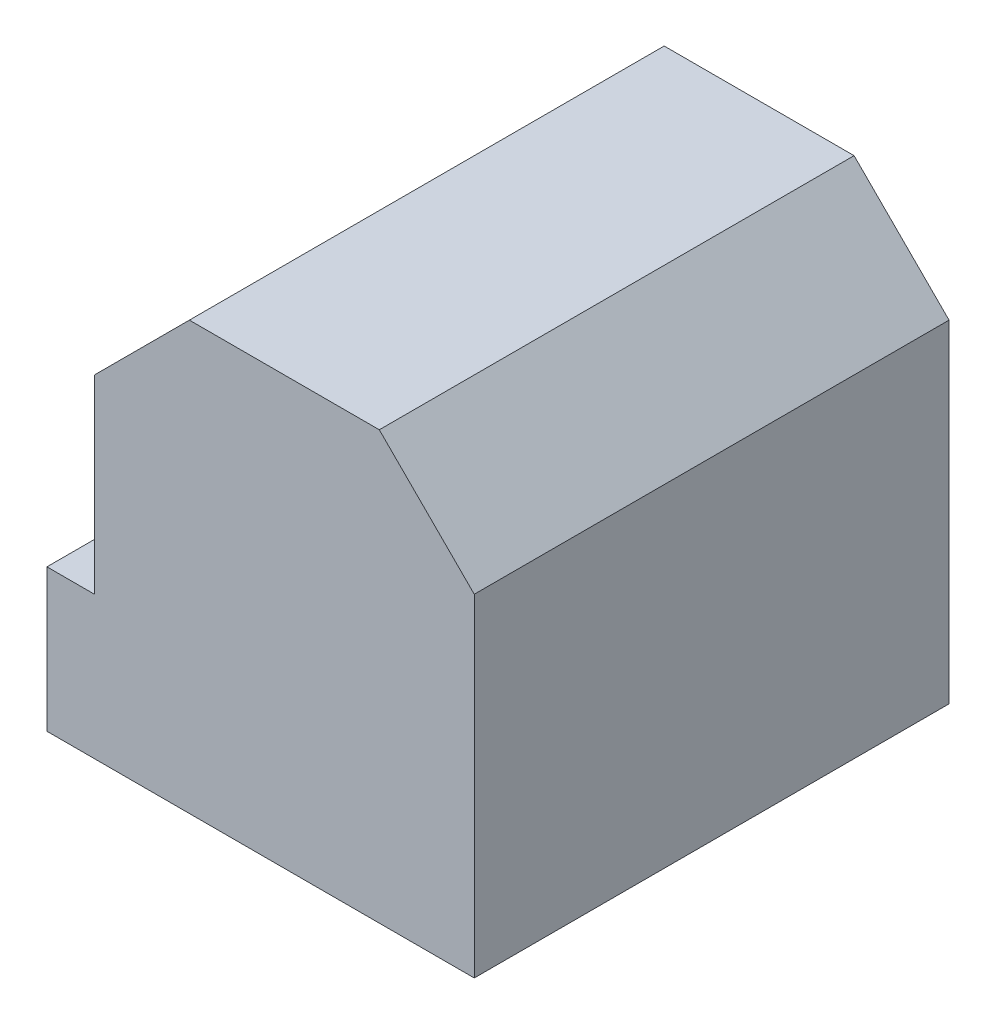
ISO-10303-21;
HEADER;
FILE_DESCRIPTION(('STEP AP214'),'2;1');
FILE_NAME('part.step','',(''),(''),'','','');
FILE_SCHEMA(('AUTOMOTIVE_DESIGN { 1 0 10303 214 1 1 1 1 }'));
ENDSEC;
DATA;
#1=APPLICATION_CONTEXT('core data for automotive mechanical design processes');
#2=APPLICATION_PROTOCOL_DEFINITION('international standard','automotive_design',2000,#1);
#3=PRODUCT_CONTEXT('',#1,'mechanical');
#4=PRODUCT('Part','Part','',(#3));
#5=PRODUCT_RELATED_PRODUCT_CATEGORY('part','',(#4));
#6=PRODUCT_DEFINITION_FORMATION('','',#4);
#7=PRODUCT_DEFINITION_CONTEXT('part definition',#1,'design');
#8=PRODUCT_DEFINITION('design','',#6,#7);
#9=PRODUCT_DEFINITION_SHAPE('','',#8);
#10=(LENGTH_UNIT() NAMED_UNIT(*) SI_UNIT(.MILLI.,.METRE.));
#11=(NAMED_UNIT(*) PLANE_ANGLE_UNIT() SI_UNIT($,.RADIAN.));
#12=(NAMED_UNIT(*) SI_UNIT($,.STERADIAN.) SOLID_ANGLE_UNIT());
#13=UNCERTAINTY_MEASURE_WITH_UNIT(LENGTH_MEASURE(1.E-05),#10,'distance_accuracy_value','');
#14=(GEOMETRIC_REPRESENTATION_CONTEXT(3) GLOBAL_UNCERTAINTY_ASSIGNED_CONTEXT((#13)) GLOBAL_UNIT_ASSIGNED_CONTEXT((#10,
#11,#12)) REPRESENTATION_CONTEXT('',''));
#15=CARTESIAN_POINT('',(0.,0.,0.));
#16=DIRECTION('',(0.,0.,1.));
#17=DIRECTION('',(1.,0.,0.));
#18=AXIS2_PLACEMENT_3D('',#15,#16,#17);
#19=CARTESIAN_POINT('',(0.,0.,25.));
#20=DIRECTION('',(1.,0.,0.));
#21=DIRECTION('',(0.,0.,-1.));
#22=AXIS2_PLACEMENT_3D('',#19,#20,#21);
#23=PLANE('',#22);
#24=DIRECTION('',(0.,0.,-1.));
#25=VECTOR('',#24,1.);
#26=CARTESIAN_POINT('',(0.,15.,25.));
#27=LINE('',#26,#25);
#28=CARTESIAN_POINT('',(0.,15.,25.));
#29=VERTEX_POINT('',#28);
#30=CARTESIAN_POINT('',(0.,15.,-25.));
#31=VERTEX_POINT('',#30);
#32=EDGE_CURVE('E464',#29,#31,#27,.T.);
#33=ORIENTED_EDGE('',*,*,#32,.T.);
#34=DIRECTION('',(0.,-1.,0.));
#35=VECTOR('',#34,1.);
#36=CARTESIAN_POINT('',(0.,0.,-25.));
#37=LINE('',#36,#35);
#38=CARTESIAN_POINT('',(0.,0.,-25.));
#39=VERTEX_POINT('',#38);
#40=EDGE_CURVE('E424',#31,#39,#37,.T.);
#41=ORIENTED_EDGE('',*,*,#40,.T.);
#42=DIRECTION('',(0.,0.,-1.));
#43=VECTOR('',#42,1.);
#44=CARTESIAN_POINT('',(0.,0.,25.));
#45=LINE('',#44,#43);
#46=CARTESIAN_POINT('',(0.,0.,25.));
#47=VERTEX_POINT('',#46);
#48=EDGE_CURVE('E11',#47,#39,#45,.T.);
#49=ORIENTED_EDGE('',*,*,#48,.F.);
#50=DIRECTION('',(0.,-1.,0.));
#51=VECTOR('',#50,1.);
#52=CARTESIAN_POINT('',(0.,0.,25.));
#53=LINE('',#52,#51);
#54=EDGE_CURVE('E450',#29,#47,#53,.T.);
#55=ORIENTED_EDGE('',*,*,#54,.F.);
#56=EDGE_LOOP('',(#33,#41,#49,#55));
#57=FACE_BOUND('',#56,.T.);
#58=ADVANCED_FACE('F348',(#57),#23,.F.);
#59=CARTESIAN_POINT('',(0.,0.,25.));
#60=DIRECTION('',(0.,1.,0.));
#61=DIRECTION('',(0.,0.,1.));
#62=AXIS2_PLACEMENT_3D('',#59,#60,#61);
#63=PLANE('',#62);
#64=CARTESIAN_POINT('',(25.,0.,0.));
#65=DIRECTION('',(0.,-1.,0.));
#66=DIRECTION('',(0.,0.,-1.));
#67=AXIS2_PLACEMENT_3D('',#64,#65,#66);
#68=CIRCLE('',#67,5.1);
#69=CARTESIAN_POINT('',(25.,0.,-5.1));
#70=VERTEX_POINT('',#69);
#71=EDGE_CURVE('E421',#70,#70,#68,.T.);
#72=ORIENTED_EDGE('',*,*,#71,.F.);
#73=EDGE_LOOP('',(#72));
#74=FACE_BOUND('',#73,.T.);
#75=ORIENTED_EDGE('',*,*,#48,.T.);
#76=DIRECTION('',(1.,0.,0.));
#77=VECTOR('',#76,1.);
#78=CARTESIAN_POINT('',(0.,0.,-25.));
#79=LINE('',#78,#77);
#80=CARTESIAN_POINT('',(45.,0.,-25.));
#81=VERTEX_POINT('',#80);
#82=EDGE_CURVE('E429',#39,#81,#79,.T.);
#83=ORIENTED_EDGE('',*,*,#82,.T.);
#84=DIRECTION('',(0.,0.,-1.));
#85=VECTOR('',#84,1.);
#86=CARTESIAN_POINT('',(45.,0.,25.));
#87=LINE('',#86,#85);
#88=CARTESIAN_POINT('',(45.,0.,25.));
#89=VERTEX_POINT('',#88);
#90=EDGE_CURVE('E355',#89,#81,#87,.T.);
#91=ORIENTED_EDGE('',*,*,#90,.F.);
#92=DIRECTION('',(1.,0.,0.));
#93=VECTOR('',#92,1.);
#94=CARTESIAN_POINT('',(0.,0.,25.));
#95=LINE('',#94,#93);
#96=EDGE_CURVE('E452',#47,#89,#95,.T.);
#97=ORIENTED_EDGE('',*,*,#96,.F.);
#98=EDGE_LOOP('',(#75,#83,#91,#97));
#99=FACE_BOUND('',#98,.T.);
#100=ADVANCED_FACE('F488',(#74,#99),#63,.F.);
#101=CARTESIAN_POINT('',(45.,0.,25.));
#102=DIRECTION('',(-1.,0.,0.));
#103=DIRECTION('',(0.,0.,1.));
#104=AXIS2_PLACEMENT_3D('',#101,#102,#103);
#105=PLANE('',#104);
#106=ORIENTED_EDGE('',*,*,#90,.T.);
#107=DIRECTION('',(0.,1.,0.));
#108=VECTOR('',#107,1.);
#109=CARTESIAN_POINT('',(45.,0.,-25.));
#110=LINE('',#109,#108);
#111=CARTESIAN_POINT('',(45.,35.,-25.));
#112=VERTEX_POINT('',#111);
#113=EDGE_CURVE('E432',#81,#112,#110,.T.);
#114=ORIENTED_EDGE('',*,*,#113,.T.);
#115=DIRECTION('',(0.,0.,-1.));
#116=VECTOR('',#115,1.);
#117=CARTESIAN_POINT('',(45.,35.,25.));
#118=LINE('',#117,#116);
#119=CARTESIAN_POINT('',(45.,35.,25.));
#120=VERTEX_POINT('',#119);
#121=EDGE_CURVE('E474',#120,#112,#118,.T.);
#122=ORIENTED_EDGE('',*,*,#121,.F.);
#123=DIRECTION('',(0.,1.,0.));
#124=VECTOR('',#123,1.);
#125=CARTESIAN_POINT('',(45.,0.,25.));
#126=LINE('',#125,#124);
#127=EDGE_CURVE('E454',#89,#120,#126,.T.);
#128=ORIENTED_EDGE('',*,*,#127,.F.);
#129=EDGE_LOOP('',(#106,#114,#122,#128));
#130=FACE_BOUND('',#129,.T.);
#131=ADVANCED_FACE('F479',(#130),#105,.F.);
#132=CARTESIAN_POINT('',(35.,45.,25.));
#133=DIRECTION('',(-0.707106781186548,-0.707106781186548,0.));
#134=DIRECTION('',(0.707106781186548,-0.707106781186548,0.));
#135=AXIS2_PLACEMENT_3D('',#132,#133,#134);
#136=PLANE('',#135);
#137=ORIENTED_EDGE('',*,*,#121,.T.);
#138=DIRECTION('',(-0.707106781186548,0.707106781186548,0.));
#139=VECTOR('',#138,1.);
#140=CARTESIAN_POINT('',(35.,45.,-25.));
#141=LINE('',#140,#139);
#142=CARTESIAN_POINT('',(35.,45.,-25.));
#143=VERTEX_POINT('',#142);
#144=EDGE_CURVE('E435',#112,#143,#141,.T.);
#145=ORIENTED_EDGE('',*,*,#144,.T.);
#146=DIRECTION('',(0.,0.,-1.));
#147=VECTOR('',#146,1.);
#148=CARTESIAN_POINT('',(35.,45.,25.));
#149=LINE('',#148,#147);
#150=CARTESIAN_POINT('',(35.,45.,25.));
#151=VERTEX_POINT('',#150);
#152=EDGE_CURVE('E472',#151,#143,#149,.T.);
#153=ORIENTED_EDGE('',*,*,#152,.F.);
#154=DIRECTION('',(-0.707106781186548,0.707106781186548,0.));
#155=VECTOR('',#154,1.);
#156=CARTESIAN_POINT('',(35.,45.,25.));
#157=LINE('',#156,#155);
#158=EDGE_CURVE('E456',#120,#151,#157,.T.);
#159=ORIENTED_EDGE('',*,*,#158,.F.);
#160=EDGE_LOOP('',(#137,#145,#153,#159));
#161=FACE_BOUND('',#160,.T.);
#162=ADVANCED_FACE('F509',(#161),#136,.F.);
#163=CARTESIAN_POINT('',(15.,45.,25.));
#164=DIRECTION('',(0.,-1.,0.));
#165=DIRECTION('',(0.,0.,-1.));
#166=AXIS2_PLACEMENT_3D('',#163,#164,#165);
#167=PLANE('',#166);
#168=ORIENTED_EDGE('',*,*,#152,.T.);
#169=DIRECTION('',(-1.,0.,0.));
#170=VECTOR('',#169,1.);
#171=CARTESIAN_POINT('',(15.,45.,-25.));
#172=LINE('',#171,#170);
#173=CARTESIAN_POINT('',(15.,45.,-25.));
#174=VERTEX_POINT('',#173);
#175=EDGE_CURVE('E438',#143,#174,#172,.T.);
#176=ORIENTED_EDGE('',*,*,#175,.T.);
#177=DIRECTION('',(0.,0.,-1.));
#178=VECTOR('',#177,1.);
#179=CARTESIAN_POINT('',(15.,45.,25.));
#180=LINE('',#179,#178);
#181=CARTESIAN_POINT('',(15.,45.,25.));
#182=VERTEX_POINT('',#181);
#183=EDGE_CURVE('E470',#182,#174,#180,.T.);
#184=ORIENTED_EDGE('',*,*,#183,.F.);
#185=DIRECTION('',(-1.,0.,0.));
#186=VECTOR('',#185,1.);
#187=CARTESIAN_POINT('',(15.,45.,25.));
#188=LINE('',#187,#186);
#189=EDGE_CURVE('E458',#151,#182,#188,.T.);
#190=ORIENTED_EDGE('',*,*,#189,.F.);
#191=EDGE_LOOP('',(#168,#176,#184,#190));
#192=FACE_BOUND('',#191,.T.);
#193=ADVANCED_FACE('F506',(#192),#167,.F.);
#194=CARTESIAN_POINT('',(5.,35.,25.));
#195=DIRECTION('',(0.707106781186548,-0.707106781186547,0.));
#196=DIRECTION('',(0.707106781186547,0.707106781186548,0.));
#197=AXIS2_PLACEMENT_3D('',#194,#195,#196);
#198=PLANE('',#197);
#199=ORIENTED_EDGE('',*,*,#183,.T.);
#200=DIRECTION('',(-0.707106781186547,-0.707106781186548,0.));
#201=VECTOR('',#200,1.);
#202=CARTESIAN_POINT('',(5.,35.,-25.));
#203=LINE('',#202,#201);
#204=CARTESIAN_POINT('',(5.,35.,-25.));
#205=VERTEX_POINT('',#204);
#206=EDGE_CURVE('E441',#174,#205,#203,.T.);
#207=ORIENTED_EDGE('',*,*,#206,.T.);
#208=DIRECTION('',(0.,0.,-1.));
#209=VECTOR('',#208,1.);
#210=CARTESIAN_POINT('',(5.,35.,25.));
#211=LINE('',#210,#209);
#212=CARTESIAN_POINT('',(5.,35.,25.));
#213=VERTEX_POINT('',#212);
#214=EDGE_CURVE('E468',#213,#205,#211,.T.);
#215=ORIENTED_EDGE('',*,*,#214,.F.);
#216=DIRECTION('',(-0.707106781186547,-0.707106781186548,0.));
#217=VECTOR('',#216,1.);
#218=CARTESIAN_POINT('',(5.,35.,25.));
#219=LINE('',#218,#217);
#220=EDGE_CURVE('E460',#182,#213,#219,.T.);
#221=ORIENTED_EDGE('',*,*,#220,.F.);
#222=EDGE_LOOP('',(#199,#207,#215,#221));
#223=FACE_BOUND('',#222,.T.);
#224=ADVANCED_FACE('F501',(#223),#198,.F.);
#225=CARTESIAN_POINT('',(5.,15.,25.));
#226=DIRECTION('',(1.,0.,0.));
#227=DIRECTION('',(0.,0.,-1.));
#228=AXIS2_PLACEMENT_3D('',#225,#226,#227);
#229=PLANE('',#228);
#230=ORIENTED_EDGE('',*,*,#214,.T.);
#231=DIRECTION('',(0.,-1.,0.));
#232=VECTOR('',#231,1.);
#233=CARTESIAN_POINT('',(5.,15.,-25.));
#234=LINE('',#233,#232);
#235=CARTESIAN_POINT('',(5.,15.,-25.));
#236=VERTEX_POINT('',#235);
#237=EDGE_CURVE('E444',#205,#236,#234,.T.);
#238=ORIENTED_EDGE('',*,*,#237,.T.);
#239=DIRECTION('',(0.,0.,-1.));
#240=VECTOR('',#239,1.);
#241=CARTESIAN_POINT('',(5.,15.,25.));
#242=LINE('',#241,#240);
#243=CARTESIAN_POINT('',(5.,15.,25.));
#244=VERTEX_POINT('',#243);
#245=EDGE_CURVE('E466',#244,#236,#242,.T.);
#246=ORIENTED_EDGE('',*,*,#245,.F.);
#247=DIRECTION('',(0.,-1.,0.));
#248=VECTOR('',#247,1.);
#249=CARTESIAN_POINT('',(5.,15.,25.));
#250=LINE('',#249,#248);
#251=EDGE_CURVE('E367',#213,#244,#250,.T.);
#252=ORIENTED_EDGE('',*,*,#251,.F.);
#253=EDGE_LOOP('',(#230,#238,#246,#252));
#254=FACE_BOUND('',#253,.T.);
#255=ADVANCED_FACE('F497',(#254),#229,.F.);
#256=CARTESIAN_POINT('',(0.,15.,25.));
#257=DIRECTION('',(0.,-1.,0.));
#258=DIRECTION('',(0.,0.,-1.));
#259=AXIS2_PLACEMENT_3D('',#256,#257,#258);
#260=PLANE('',#259);
#261=ORIENTED_EDGE('',*,*,#245,.T.);
#262=DIRECTION('',(-1.,0.,0.));
#263=VECTOR('',#262,1.);
#264=CARTESIAN_POINT('',(0.,15.,-25.));
#265=LINE('',#264,#263);
#266=EDGE_CURVE('E447',#236,#31,#265,.T.);
#267=ORIENTED_EDGE('',*,*,#266,.T.);
#268=ORIENTED_EDGE('',*,*,#32,.F.);
#269=DIRECTION('',(-1.,0.,0.));
#270=VECTOR('',#269,1.);
#271=CARTESIAN_POINT('',(0.,15.,25.));
#272=LINE('',#271,#270);
#273=EDGE_CURVE('E362',#244,#29,#272,.T.);
#274=ORIENTED_EDGE('',*,*,#273,.F.);
#275=EDGE_LOOP('',(#261,#267,#268,#274));
#276=FACE_BOUND('',#275,.T.);
#277=ADVANCED_FACE('F495',(#276),#260,.F.);
#278=CARTESIAN_POINT('',(0.,15.,25.));
#279=DIRECTION('',(0.,0.,-1.));
#280=DIRECTION('',(-1.,0.,0.));
#281=AXIS2_PLACEMENT_3D('',#278,#279,#280);
#282=PLANE('',#281);
#283=ORIENTED_EDGE('',*,*,#54,.T.);
#284=ORIENTED_EDGE('',*,*,#96,.T.);
#285=ORIENTED_EDGE('',*,*,#127,.T.);
#286=ORIENTED_EDGE('',*,*,#158,.T.);
#287=ORIENTED_EDGE('',*,*,#189,.T.);
#288=ORIENTED_EDGE('',*,*,#220,.T.);
#289=ORIENTED_EDGE('',*,*,#251,.T.);
#290=ORIENTED_EDGE('',*,*,#273,.T.);
#291=EDGE_LOOP('',(#283,#284,#285,#286,#287,#288,#289,#290));
#292=FACE_BOUND('',#291,.T.);
#293=ADVANCED_FACE('F511',(#292),#282,.F.);
#294=CARTESIAN_POINT('',(0.,15.,-25.));
#295=DIRECTION('',(0.,0.,-1.));
#296=DIRECTION('',(-1.,0.,0.));
#297=AXIS2_PLACEMENT_3D('',#294,#295,#296);
#298=PLANE('',#297);
#299=ORIENTED_EDGE('',*,*,#40,.F.);
#300=ORIENTED_EDGE('',*,*,#266,.F.);
#301=ORIENTED_EDGE('',*,*,#237,.F.);
#302=ORIENTED_EDGE('',*,*,#206,.F.);
#303=ORIENTED_EDGE('',*,*,#175,.F.);
#304=ORIENTED_EDGE('',*,*,#144,.F.);
#305=ORIENTED_EDGE('',*,*,#113,.F.);
#306=ORIENTED_EDGE('',*,*,#82,.F.);
#307=EDGE_LOOP('',(#299,#300,#301,#302,#303,#304,#305,#306));
#308=FACE_BOUND('',#307,.T.);
#309=ADVANCED_FACE('F486',(#308),#298,.T.);
#310=CARTESIAN_POINT('',(25.,0.,0.));
#311=DIRECTION('',(0.,-1.,0.));
#312=DIRECTION('',(0.,0.,-1.));
#313=AXIS2_PLACEMENT_3D('',#310,#311,#312);
#314=CYLINDRICAL_SURFACE('',#313,5.1);
#315=CARTESIAN_POINT('',(25.,26.75,0.));
#316=DIRECTION('',(0.,-1.,0.));
#317=DIRECTION('',(0.,0.,-1.));
#318=AXIS2_PLACEMENT_3D('',#315,#316,#317);
#319=CIRCLE('',#318,5.09999999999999);
#320=CARTESIAN_POINT('',(25.,26.75,-5.09999999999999));
#321=VERTEX_POINT('',#320);
#322=EDGE_CURVE('E419',#321,#321,#319,.T.);
#323=ORIENTED_EDGE('',*,*,#322,.F.);
#324=EDGE_LOOP('',(#323));
#325=FACE_BOUND('',#324,.T.);
#326=ORIENTED_EDGE('',*,*,#71,.T.);
#327=EDGE_LOOP('',(#326));
#328=FACE_BOUND('',#327,.T.);
#329=ADVANCED_FACE('F415',(#325,#328),#314,.F.);
#330=CARTESIAN_POINT('',(25.,26.75,0.));
#331=DIRECTION('',(0.,-1.,0.));
#332=DIRECTION('',(0.,0.,-1.));
#333=AXIS2_PLACEMENT_3D('',#330,#331,#332);
#334=CONICAL_SURFACE('',#333,5.09999999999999,1.02974425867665);
#335=CARTESIAN_POINT('',(25.,29.8143891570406,0.));
#336=VERTEX_POINT('',#335);
#337=VERTEX_LOOP('',#336);
#338=FACE_BOUND('',#337,.T.);
#339=ORIENTED_EDGE('',*,*,#322,.T.);
#340=EDGE_LOOP('',(#339));
#341=FACE_BOUND('',#340,.T.);
#342=ADVANCED_FACE('F412',(#338,#341),#334,.F.);
#343=CLOSED_SHELL('',(#58,#100,#131,#162,#193,#224,#255,#277,#293,#309,#329,#342));
#344=MANIFOLD_SOLID_BREP('B2',#343);
#345=ADVANCED_BREP_SHAPE_REPRESENTATION('',(#18,#344),#14);
#346=SHAPE_DEFINITION_REPRESENTATION(#9,#345);
ENDSEC;
END-ISO-10303-21;
